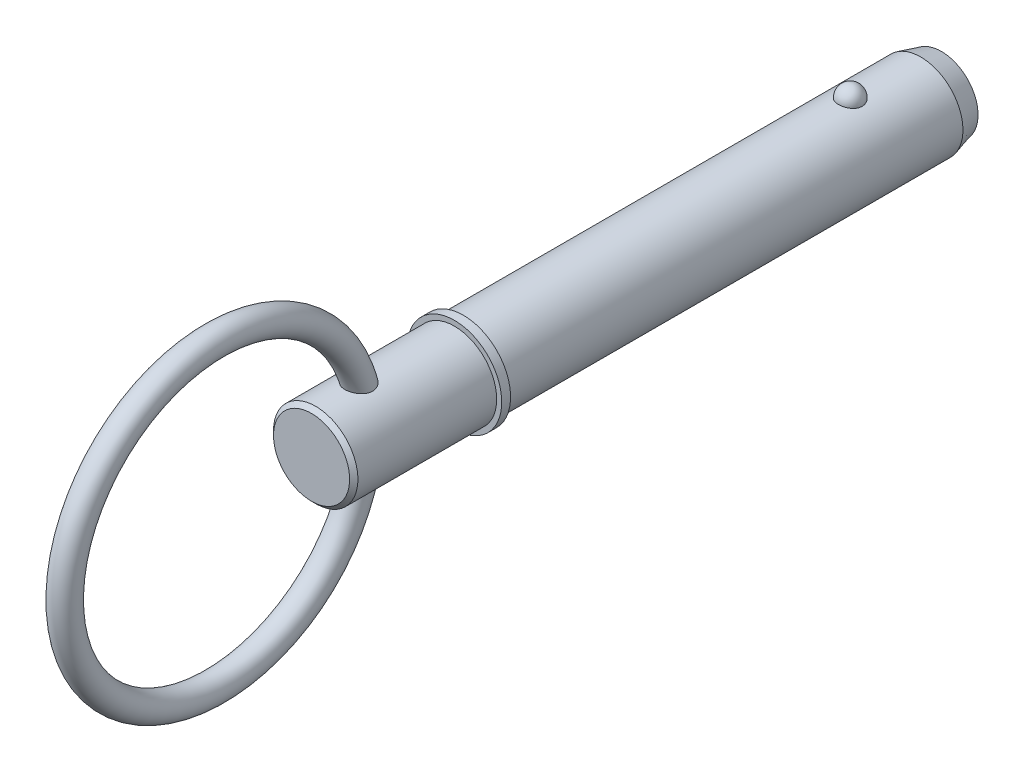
from build123d import *

# Parameters (mm, degrees)
SKETCH2_R           = 7.145
BOSS_EXTRUDE1_DEPTH = 63.5
BOSS_EXTRUDE2_START = 17.45
SKETCH3_R           = 7.145
BOSS_EXTRUDE2_DEPTH = 17.45
CHAMFER1_SIZE       = 3.5
CHAMFER1_SIZE2      = 0.937822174
SKETCH20_W          = 1.5
SKETCH20_H          = 8
SKETCH21_R          = 7.145
BOSS_EXTRUDE3_DEPTH = 25.7
CHAMFER2_SIZE       = 0.7
SKETCH24_R          = 2.25


with BuildPart() as part:
    # Sketch2 → Boss-Extrude1 (new body)
    with BuildSketch(Plane.XY):
        Circle(SKETCH2_R)
    extrude(amount=BOSS_EXTRUDE1_DEPTH)

    # Sketch3 → Boss-Extrude2 (add)
    with BuildSketch(Plane(origin=(0, 0, 0), x_dir=(-1, 0, 0), z_dir=(0, 0, -1)).offset(BOSS_EXTRUDE2_START)):
        Circle(SKETCH3_R)
    extrude(amount=-BOSS_EXTRUDE2_DEPTH)

    # Chamfer1
    chamfer1_edges = [part.edges().sort_by_distance(p)[0] for p in [
        (7.145, 0, -17.45),
    ]]
    chamfer1_side = [part.faces().sort_by_distance(p)[0] for p in [
        (7.145, 0, -8.725),
    ]]
    chamfer(chamfer1_edges, length=CHAMFER1_SIZE, length2=CHAMFER1_SIZE2, reference=chamfer1_side[0])

    # Sketch18 → Revolve1 (revolve)
    with BuildSketch(Plane(origin=(0, 0, 0), x_dir=(0, 0, -1), z_dir=(1, 0, 0))):
        with BuildLine():
            Line((2.02, 9.165), (2.02, 5.125))
            ThreePointArc((2.02, 5.125), (0, 7.145), (2.02, 9.165))
        make_face()
    revolve(axis=Axis((0, 9.165, -2.02), (0, -1, 0)))

    # Sketch20 → Revolve2 (revolve)
    with BuildSketch(Plane(origin=(0, 0, 0), x_dir=(0, 0, -1), z_dir=(1, 0, 0)), mode=Mode.PRIVATE) as revolve2_sk:
        with Locations((-64.25, 4)):
            Rectangle(SKETCH20_W, SKETCH20_H)
    revolve(revolve2_sk.sketch.rotate(Axis((0, 0, 33.728787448), (0, 0, 1)), 90), axis=Axis((0, 0, 33.728787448), (0, 0, 1)))

    # Sketch21 → Boss-Extrude3 (add)
    with BuildSketch(Plane(origin=(0, 0, 63.5), x_dir=(-1, 0, 0), z_dir=(0, 0, -1))):
        Circle(SKETCH21_R)
    extrude(amount=-BOSS_EXTRUDE3_DEPTH)

    # Chamfer2
    chamfer2_edges = [part.edges().sort_by_distance(p)[0] for p in [
        (7.145, 0, 89.2),
    ]]
    chamfer(chamfer2_edges, length=CHAMFER2_SIZE)

    # Sweep1: sweep along a path in Sketch23
    with BuildLine(Plane(origin=(0, 0, 0), x_dir=(0, 0, -1), z_dir=(1, 0, 0))) as sweep1_path:
        CenterArc((-105.6, 0), 25.4, 0, 360)
    # Sketch24 → Sweep1 (sweep)
    with BuildSketch(Plane(origin=(0, 0, 0), x_dir=(1, 0, 0), z_dir=(0, 1, 0))):
        with Locations((0, -80.2)):
            Circle(SKETCH24_R)
    sweep(path=sweep1_path.line)


solid = part.part
